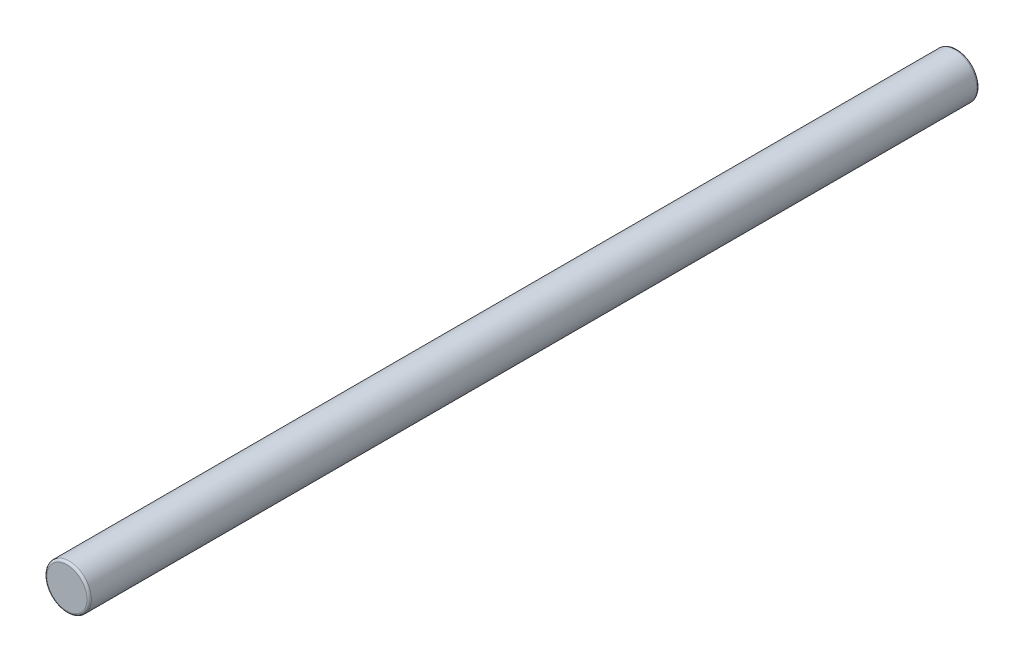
ISO-10303-21;
HEADER;
FILE_DESCRIPTION(('STEP AP214'),'2;1');
FILE_NAME('part.step','',(''),(''),'','','');
FILE_SCHEMA(('AUTOMOTIVE_DESIGN { 1 0 10303 214 1 1 1 1 }'));
ENDSEC;
DATA;
#1=APPLICATION_CONTEXT('core data for automotive mechanical design processes');
#2=APPLICATION_PROTOCOL_DEFINITION('international standard','automotive_design',2000,#1);
#3=PRODUCT_CONTEXT('',#1,'mechanical');
#4=PRODUCT('Part','Part','',(#3));
#5=PRODUCT_RELATED_PRODUCT_CATEGORY('part','',(#4));
#6=PRODUCT_DEFINITION_FORMATION('','',#4);
#7=PRODUCT_DEFINITION_CONTEXT('part definition',#1,'design');
#8=PRODUCT_DEFINITION('design','',#6,#7);
#9=PRODUCT_DEFINITION_SHAPE('','',#8);
#10=(LENGTH_UNIT() NAMED_UNIT(*) SI_UNIT(.MILLI.,.METRE.));
#11=(NAMED_UNIT(*) PLANE_ANGLE_UNIT() SI_UNIT($,.RADIAN.));
#12=(NAMED_UNIT(*) SI_UNIT($,.STERADIAN.) SOLID_ANGLE_UNIT());
#13=UNCERTAINTY_MEASURE_WITH_UNIT(LENGTH_MEASURE(1.E-05),#10,'distance_accuracy_value','');
#14=(GEOMETRIC_REPRESENTATION_CONTEXT(3) GLOBAL_UNCERTAINTY_ASSIGNED_CONTEXT((#13)) GLOBAL_UNIT_ASSIGNED_CONTEXT((#10,
#11,#12)) REPRESENTATION_CONTEXT('',''));
#15=CARTESIAN_POINT('',(0.,0.,0.));
#16=DIRECTION('',(0.,0.,1.));
#17=DIRECTION('',(1.,0.,0.));
#18=AXIS2_PLACEMENT_3D('',#15,#16,#17);
#19=CARTESIAN_POINT('',(0.,0.,40.));
#20=DIRECTION('',(0.,0.,-1.));
#21=DIRECTION('',(-1.,0.,0.));
#22=AXIS2_PLACEMENT_3D('',#19,#20,#21);
#23=CYLINDRICAL_SURFACE('',#22,1.);
#24=CARTESIAN_POINT('',(0.,0.,39.9));
#25=DIRECTION('',(0.,0.,1.));
#26=DIRECTION('',(1.,0.,0.));
#27=AXIS2_PLACEMENT_3D('',#24,#25,#26);
#28=CIRCLE('',#27,1.);
#29=CARTESIAN_POINT('',(1.,0.,39.9));
#30=VERTEX_POINT('',#29);
#31=EDGE_CURVE('E35',#30,#30,#28,.F.);
#32=ORIENTED_EDGE('',*,*,#31,.T.);
#33=EDGE_LOOP('',(#32));
#34=FACE_BOUND('',#33,.T.);
#35=CARTESIAN_POINT('',(0.,0.,0.100000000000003));
#36=DIRECTION('',(0.,0.,1.));
#37=DIRECTION('',(1.,0.,0.));
#38=AXIS2_PLACEMENT_3D('',#35,#36,#37);
#39=CIRCLE('',#38,1.);
#40=CARTESIAN_POINT('',(1.,0.,0.100000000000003));
#41=VERTEX_POINT('',#40);
#42=EDGE_CURVE('E39',#41,#41,#39,.T.);
#43=ORIENTED_EDGE('',*,*,#42,.T.);
#44=EDGE_LOOP('',(#43));
#45=FACE_BOUND('',#44,.T.);
#46=ADVANCED_FACE('F29',(#34,#45),#23,.T.);
#47=CARTESIAN_POINT('',(0.,0.,40.));
#48=DIRECTION('',(0.,0.,1.));
#49=DIRECTION('',(1.,0.,0.));
#50=AXIS2_PLACEMENT_3D('',#47,#48,#49);
#51=PLANE('',#50);
#52=CARTESIAN_POINT('',(0.,0.,40.));
#53=DIRECTION('',(0.,0.,1.));
#54=DIRECTION('',(1.,0.,0.));
#55=AXIS2_PLACEMENT_3D('',#52,#53,#54);
#56=CIRCLE('',#55,0.900000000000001);
#57=CARTESIAN_POINT('',(0.900000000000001,0.,40.));
#58=VERTEX_POINT('',#57);
#59=EDGE_CURVE('E43',#58,#58,#56,.T.);
#60=ORIENTED_EDGE('',*,*,#59,.T.);
#61=EDGE_LOOP('',(#60));
#62=FACE_BOUND('',#61,.T.);
#63=ADVANCED_FACE('F49',(#62),#51,.T.);
#64=CARTESIAN_POINT('',(0.,0.,0.));
#65=DIRECTION('',(0.,0.,1.));
#66=DIRECTION('',(1.,0.,0.));
#67=AXIS2_PLACEMENT_3D('',#64,#65,#66);
#68=PLANE('',#67);
#69=CARTESIAN_POINT('',(0.,0.,0.));
#70=DIRECTION('',(0.,0.,1.));
#71=DIRECTION('',(1.,0.,0.));
#72=AXIS2_PLACEMENT_3D('',#69,#70,#71);
#73=CIRCLE('',#72,0.900000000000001);
#74=CARTESIAN_POINT('',(0.900000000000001,0.,0.));
#75=VERTEX_POINT('',#74);
#76=EDGE_CURVE('E10',#75,#75,#73,.F.);
#77=ORIENTED_EDGE('',*,*,#76,.T.);
#78=EDGE_LOOP('',(#77));
#79=FACE_BOUND('',#78,.T.);
#80=ADVANCED_FACE('F54',(#79),#68,.F.);
#81=CARTESIAN_POINT('',(0.,0.,39.9));
#82=DIRECTION('',(0.,0.,1.));
#83=DIRECTION('',(1.,0.,0.));
#84=AXIS2_PLACEMENT_3D('',#81,#82,#83);
#85=TOROIDAL_SURFACE('',#84,0.900000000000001,0.1);
#86=ORIENTED_EDGE('',*,*,#31,.F.);
#87=EDGE_LOOP('',(#86));
#88=FACE_BOUND('',#87,.T.);
#89=ORIENTED_EDGE('',*,*,#59,.F.);
#90=EDGE_LOOP('',(#89));
#91=FACE_BOUND('',#90,.T.);
#92=ADVANCED_FACE('F51',(#88,#91),#85,.T.);
#93=CARTESIAN_POINT('',(0.,0.,0.100000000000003));
#94=DIRECTION('',(0.,0.,1.));
#95=DIRECTION('',(1.,0.,0.));
#96=AXIS2_PLACEMENT_3D('',#93,#94,#95);
#97=TOROIDAL_SURFACE('',#96,0.900000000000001,0.1);
#98=ORIENTED_EDGE('',*,*,#76,.F.);
#99=EDGE_LOOP('',(#98));
#100=FACE_BOUND('',#99,.T.);
#101=ORIENTED_EDGE('',*,*,#42,.F.);
#102=EDGE_LOOP('',(#101));
#103=FACE_BOUND('',#102,.T.);
#104=ADVANCED_FACE('F53',(#100,#103),#97,.T.);
#105=CLOSED_SHELL('',(#46,#63,#80,#92,#104));
#106=MANIFOLD_SOLID_BREP('B2',#105);
#107=ADVANCED_BREP_SHAPE_REPRESENTATION('',(#18,#106),#14);
#108=SHAPE_DEFINITION_REPRESENTATION(#9,#107);
ENDSEC;
END-ISO-10303-21;
